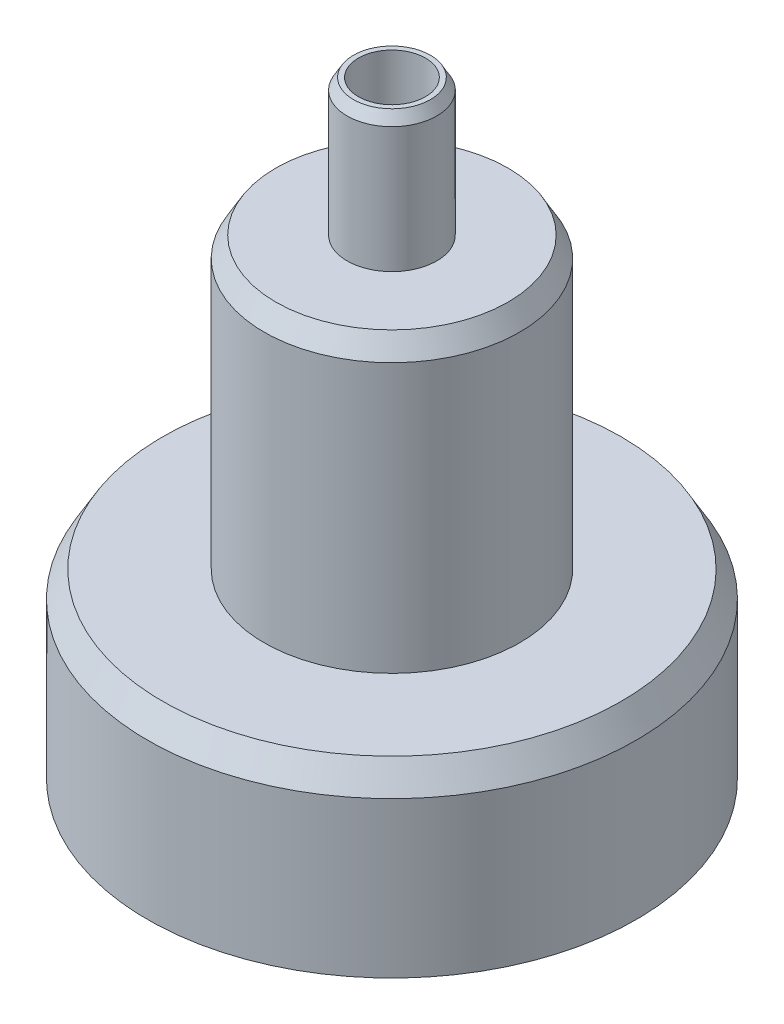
from build123d import *


with BuildPart() as part:
    # Sketch1 → Revolve1 (revolve)
    with BuildSketch(Plane.XY, mode=Mode.PRIVATE) as revolve1_sk:
        Polygon((-34.6, 0), (-30.9, 0), (-30.9, 2), (-33.1606, 2), (-33.1606, 5.0734), (-30.9, 5.0734), (-30.9, 12.7), (-18.034, 12.7), (-4.75, 35.2), (-4.75, 86), (-5.44933358, 86), (-6.35, 84.44), (-6.35, 66.66), (-16.44877823, 66.66), (-18.1, 63.8), (-18.1, 25.7), (-32.463804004, 25.7), (-34.6, 22), align=None)
    revolve(revolve1_sk.sketch.rotate(Axis((0, 0, 0), (0, 1, 0)), 270), axis=Axis((0, 0, 0), (0, 1, 0)))


solid = part.part
